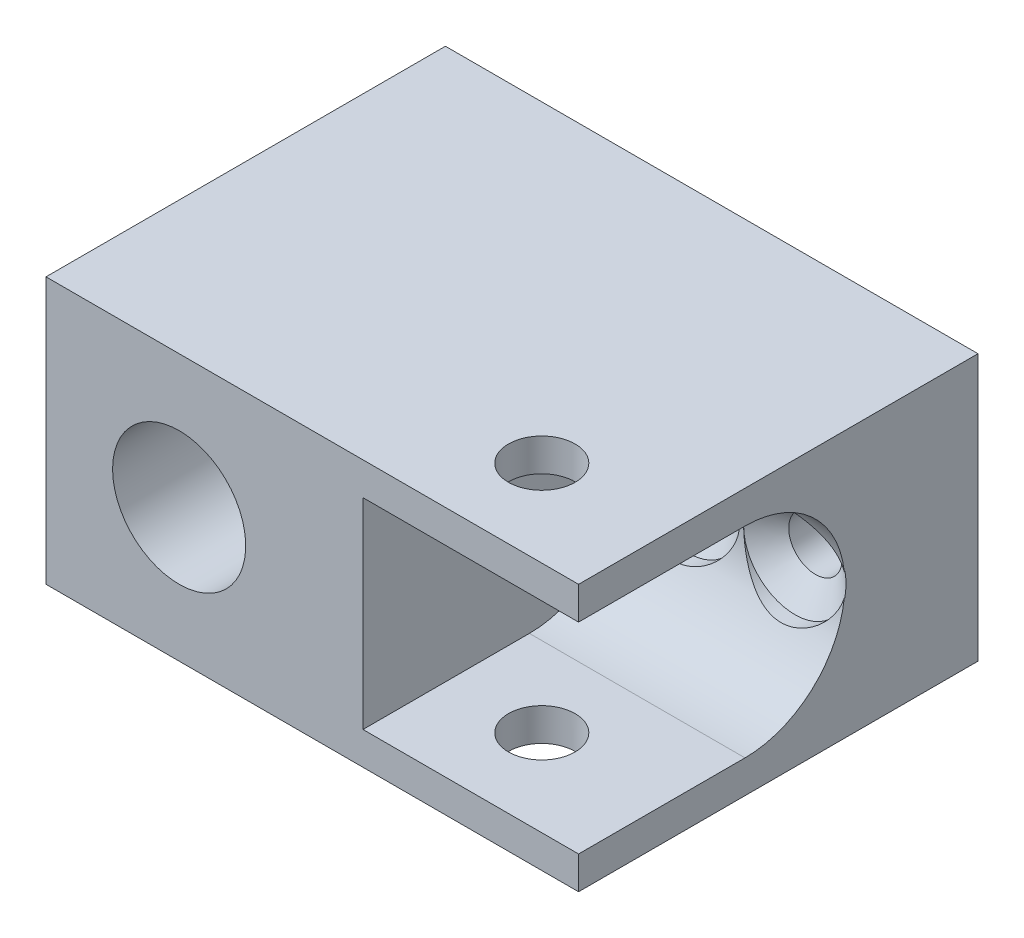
from build123d import *

# Parameters (mm, degrees)
SKETCH1_W                                  = 50.8
SKETCH1_H                                  = 25.4
SKETCH1_R                                  = 6.35
BOSS_EXTRUDE1_DEPTH                        = 38.1
SKETCH2_W                                  = 41.129834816
SKETCH2_H                                  = 19.1516
CUT_EXTRUDE1_DEPTH                         = 25.4
SKETCH3_R                                  = 3.175
CUT_EXTRUDE2_DEPTH                         = 69.391593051
FILLET1_R                                  = 9.525
CSK_FOR_10_FLAT_HEAD_MACHINE_SCREW_2_COUNT = 2
CSK_FOR_10_FLAT_HEAD_MACHINE_SCREW_2_PITCH = 10.16
SKETCH9_R                                  = 4.8895
CUT_EXTRUDE4_DEPTH                         = 10


with BuildPart() as part:
    # Sketch1 → Boss-Extrude1 (new body)
    with BuildSketch(Plane.XY):
        with Locations((25.4, 0)):
            Rectangle(SKETCH1_W, SKETCH1_H)
        with Locations(Location((12.7, 0, 0), (0, 0, 180))):
            Circle(SKETCH1_R, mode=Mode.SUBTRACT)
    extrude(amount=BOSS_EXTRUDE1_DEPTH)

    # Sketch2 → Cut-Extrude1 (cut)
    with BuildSketch(Plane.XY.offset(38.1)):
        with Locations((50.8, 0)):
            Rectangle(SKETCH2_W, SKETCH2_H)
    extrude(amount=-CUT_EXTRUDE1_DEPTH, mode=Mode.SUBTRACT)

    # Sketch3 → Cut-Extrude2 (cut, through all)
    with BuildSketch(Plane(origin=(0, 12.7, 0), x_dir=(1, 0, 0), z_dir=(0, 1, 0))):
        with Locations(Location((39.036182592, -29.845, 0), (0, 0, 180))):
            Circle(SKETCH3_R)
    extrude(amount=-CUT_EXTRUDE2_DEPTH, mode=Mode.SUBTRACT)

    # Fillet1
    fillet1_edges = [part.edges().sort_by_distance(p)[0] for p in [
        (40.517541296, 9.5758, 12.7),
        (40.517541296, -9.5758, 12.7),
    ]]
    fillet(fillet1_edges, radius=FILLET1_R)

    # Sketch7 → CSK for _10 Flat Head Machine Screw _100 (revolve, cut)
    with BuildSketch(Plane(origin=(35.8775, 0, 12.7), x_dir=(0, -1, 0), z_dir=(1, 0, 0))):
        Polygon((0, 0), (0, 12.7), (2.5527, 12.7), (2.5527, 1.960808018), (4.8895, 0), align=None)
    csk_for_10_flat_head_machine_screw_100 = revolve(axis=Axis((35.8775, 0, 19.05), (0, 0, -1)), mode=Mode.SUBTRACT)

    # CSK for _10 Flat Head Machine Screw  2: CSK for _10 Flat Head Machine Screw _100 ×2
    with Locations(*[(i * CSK_FOR_10_FLAT_HEAD_MACHINE_SCREW_2_PITCH, 0, 0) for i in range(1, CSK_FOR_10_FLAT_HEAD_MACHINE_SCREW_2_COUNT)]):
        add(csk_for_10_flat_head_machine_screw_100, mode=Mode.SUBTRACT)

    # Sketch9 → Cut-Extrude4 (cut)
    with BuildSketch(Plane(origin=(0, 0, 12.7), x_dir=(-1, 0, 0), z_dir=(0, 0, -1))):
        with Locations((-46.0375, 0)):
            Circle(SKETCH9_R)
        with Locations((-35.8775, 0)):
            Circle(SKETCH9_R)
        with BuildLine():
            Line((-50.8, 0.0508), (-41.148263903, 0.0508))
            ThreePointArc((-41.148263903, 0.0508), (-45.505532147, 4.860475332), (-50.8, 1.107160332))
            Line((-50.8, 1.107160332), (-50.8, 0.0508))
        make_face()
        with BuildLine():
            Line((-40.766736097, 0.0508), (-30.988263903, 0.0508))
            ThreePointArc((-30.988263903, 0.0508), (-35.8775, 4.8895), (-40.766736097, 0.0508))
        make_face()
    extrude(amount=-CUT_EXTRUDE4_DEPTH, mode=Mode.SUBTRACT)


solid = part.part
